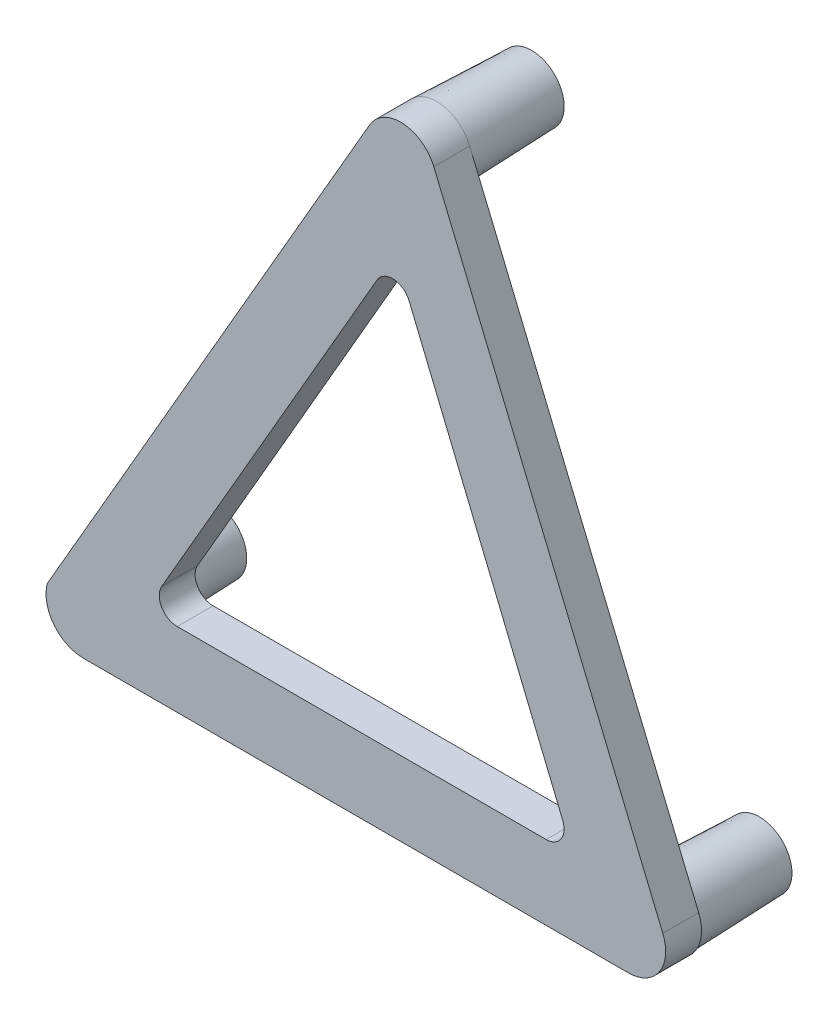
from build123d import *

# Parameters (mm, degrees)
BOSS_EXTRU_1_DEPTH           = 2
CONG_1_R                     = 1
ESQUISSE2_R                  = 2
BOSS_EXTRU_2_DEPTH           = 5.3
BOSS_EXTRU_2_DRAFT           = -2
BOSS_EXTRU_2_PROFILE_2_DEPTH = 5.3
BOSS_EXTRU_2_PROFILE_2_DRAFT = -2
BOSS_EXTRU_2_PROFILE_3_DEPTH = 5.3
BOSS_EXTRU_2_PROFILE_3_DRAFT = -2


with BuildPart() as part:
    # Esquisse1 → Boss.-Extru.1 (new body)
    with BuildSketch(Plane.XY):
        with BuildLine():
            Line((15.967949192, 31.657299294), (-2.006186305, 0.52518339))
            ThreePointArc((-2.006186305, 0.52518339), (-1.641602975, -1.267178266), (0, -2.073789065))
            Line((0, -2.073789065), (30.4, -2.073789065))
            ThreePointArc((30.4, -2.073789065), (32.125593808, -1.150185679), (32.31413227, 0.797934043))
            Line((32.31413227, 0.797934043), (19.546024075, 31.42684144))
            ThreePointArc((19.546024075, 31.42684144), (17.828550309, 32.653163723), (15.967949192, 31.657299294))
        make_face()
        Polygon((27.303688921, 2.073789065), (17.398650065, 26.135345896), (3.506703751, 2.073789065), align=None, mode=Mode.SUBTRACT)
    extrude(amount=BOSS_EXTRU_1_DEPTH)

    # Cong_1
    cong_1_edges = [part.edges().sort_by_distance(p)[0] for p in [
        (3.506703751, 2.073789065, 1),
        (27.303688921, 2.073789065, 1),
        (17.398650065, 26.135345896, 1),
    ]]
    fillet(cong_1_edges, radius=CONG_1_R)


with BuildPart() as boss_extru_2_tool:
    # Esquisse2 → Boss.-Extru.2 (with draft: the straight prism first)
    with BuildSketch(Plane.XY):
        with Locations((30.4, 0)):
            Circle(ESQUISSE2_R)
    extrude(amount=-BOSS_EXTRU_2_DEPTH)
    # Boss.-Extru.2: the draft: its side faces are tilted about the plane it starts from
    boss_extru_2_sides = [boss_extru_2_tool.faces().sort_by_distance(p)[0] for p in [
        (28.4, 0, -2.65),
    ]]
    draft(boss_extru_2_sides, Plane.XY, BOSS_EXTRU_2_DRAFT)


with BuildPart() as part_1:
    add(part.part)

    # Boss.-Extru.2: add boss_extru_2_tool
    add(boss_extru_2_tool.part)


with BuildPart() as boss_extru_2_profile_2_tool:
    # Esquisse2 → Boss.-Extru.2 profile 2 (with draft: the straight prism first)
    with BuildSketch(Plane.XY):
        Circle(ESQUISSE2_R)
    extrude(amount=-BOSS_EXTRU_2_PROFILE_2_DEPTH)
    # Boss.-Extru.2 profile 2: the draft: its side faces are tilted about the plane it starts from
    boss_extru_2_profile_2_sides = [boss_extru_2_profile_2_tool.faces().sort_by_distance(p)[0] for p in [
        (-2, 0, -2.65),
    ]]
    draft(boss_extru_2_profile_2_sides, Plane.XY, BOSS_EXTRU_2_PROFILE_2_DRAFT)


with BuildPart() as part_2:
    add(part_1.part)

    # Boss.-Extru.2 profile 2: add boss_extru_2_profile_2_tool
    add(boss_extru_2_profile_2_tool.part)


with BuildPart() as boss_extru_2_profile_3_tool:
    # Esquisse2 → Boss.-Extru.2 profile 3 (with draft: the straight prism first)
    with BuildSketch(Plane.XY):
        with Locations((17.7, 30.657299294)):
            Circle(ESQUISSE2_R)
    extrude(amount=-BOSS_EXTRU_2_PROFILE_3_DEPTH)
    # Boss.-Extru.2 profile 3: the draft: its side faces are tilted about the plane it starts from
    boss_extru_2_profile_3_sides = [boss_extru_2_profile_3_tool.faces().sort_by_distance(p)[0] for p in [
        (15.7, 30.657299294, -2.65),
    ]]
    draft(boss_extru_2_profile_3_sides, Plane.XY, BOSS_EXTRU_2_PROFILE_3_DRAFT)


with BuildPart() as part_3:
    add(part_2.part)

    # Boss.-Extru.2 profile 3: add boss_extru_2_profile_3_tool
    add(boss_extru_2_profile_3_tool.part)


solid = part_3.part
